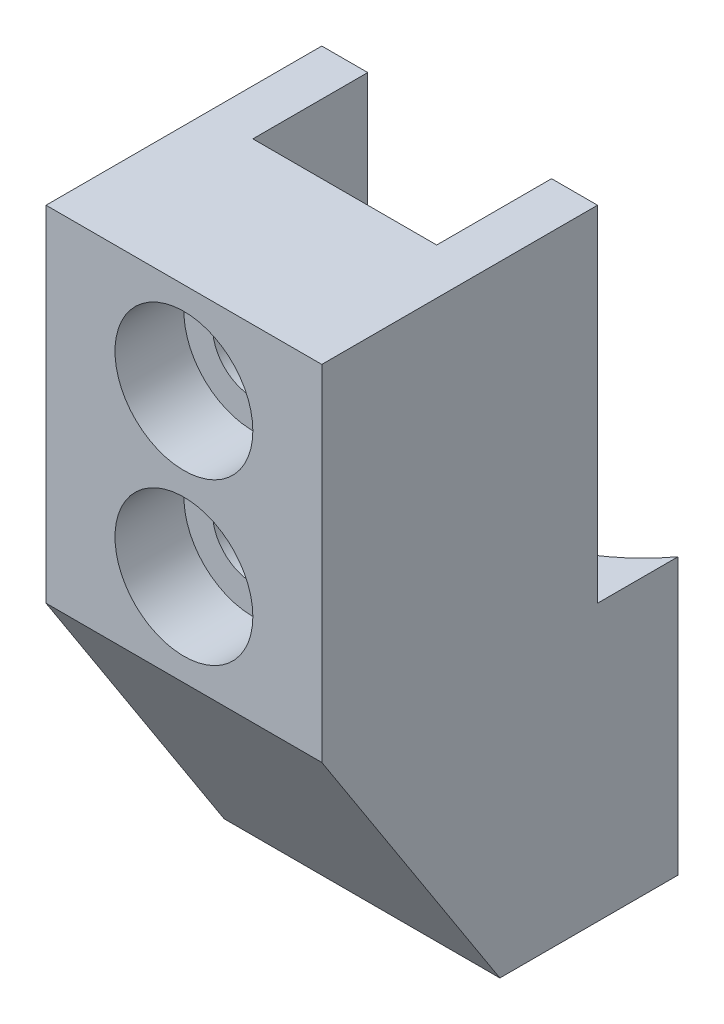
ISO-10303-21;
HEADER;
FILE_DESCRIPTION(('STEP AP214'),'2;1');
FILE_NAME('part.step','',(''),(''),'','','');
FILE_SCHEMA(('AUTOMOTIVE_DESIGN { 1 0 10303 214 1 1 1 1 }'));
ENDSEC;
DATA;
#1=APPLICATION_CONTEXT('core data for automotive mechanical design processes');
#2=APPLICATION_PROTOCOL_DEFINITION('international standard','automotive_design',2000,#1);
#3=PRODUCT_CONTEXT('',#1,'mechanical');
#4=PRODUCT('Part','Part','',(#3));
#5=PRODUCT_RELATED_PRODUCT_CATEGORY('part','',(#4));
#6=PRODUCT_DEFINITION_FORMATION('','',#4);
#7=PRODUCT_DEFINITION_CONTEXT('part definition',#1,'design');
#8=PRODUCT_DEFINITION('design','',#6,#7);
#9=PRODUCT_DEFINITION_SHAPE('','',#8);
#10=(LENGTH_UNIT() NAMED_UNIT(*) SI_UNIT(.MILLI.,.METRE.));
#11=(NAMED_UNIT(*) PLANE_ANGLE_UNIT() SI_UNIT($,.RADIAN.));
#12=(NAMED_UNIT(*) SI_UNIT($,.STERADIAN.) SOLID_ANGLE_UNIT());
#13=UNCERTAINTY_MEASURE_WITH_UNIT(LENGTH_MEASURE(1.E-05),#10,'distance_accuracy_value','');
#14=(GEOMETRIC_REPRESENTATION_CONTEXT(3) GLOBAL_UNCERTAINTY_ASSIGNED_CONTEXT((#13)) GLOBAL_UNIT_ASSIGNED_CONTEXT((#10,
#11,#12)) REPRESENTATION_CONTEXT('',''));
#15=CARTESIAN_POINT('',(0.,0.,0.));
#16=DIRECTION('',(0.,0.,1.));
#17=DIRECTION('',(1.,0.,0.));
#18=AXIS2_PLACEMENT_3D('',#15,#16,#17);
#19=CARTESIAN_POINT('',(6.,-9.,20.));
#20=DIRECTION('',(0.,0.,-1.));
#21=DIRECTION('',(-1.,0.,0.));
#22=AXIS2_PLACEMENT_3D('',#19,#20,#21);
#23=CYLINDRICAL_SURFACE('',#22,1.75);
#24=CARTESIAN_POINT('',(6.,-9.,13.));
#25=DIRECTION('',(0.,0.,-1.));
#26=DIRECTION('',(-1.,0.,0.));
#27=AXIS2_PLACEMENT_3D('',#24,#25,#26);
#28=CIRCLE('',#27,1.75);
#29=CARTESIAN_POINT('',(4.25,-9.,13.));
#30=VERTEX_POINT('',#29);
#31=EDGE_CURVE('E119',#30,#30,#28,.F.);
#32=ORIENTED_EDGE('',*,*,#31,.F.);
#33=EDGE_LOOP('',(#32));
#34=FACE_BOUND('',#33,.T.);
#35=CARTESIAN_POINT('',(6.,-9.,17.));
#36=DIRECTION('',(0.,0.,-1.));
#37=DIRECTION('',(-1.,0.,0.));
#38=AXIS2_PLACEMENT_3D('',#35,#36,#37);
#39=CIRCLE('',#38,1.75);
#40=CARTESIAN_POINT('',(4.25,-9.,17.));
#41=VERTEX_POINT('',#40);
#42=EDGE_CURVE('E20',#41,#41,#39,.T.);
#43=ORIENTED_EDGE('',*,*,#42,.F.);
#44=EDGE_LOOP('',(#43));
#45=FACE_BOUND('',#44,.T.);
#46=ADVANCED_FACE('F17',(#34,#45),#23,.F.);
#47=CARTESIAN_POINT('',(6.,-2.,20.));
#48=DIRECTION('',(0.,0.,-1.));
#49=DIRECTION('',(-1.,0.,0.));
#50=AXIS2_PLACEMENT_3D('',#47,#48,#49);
#51=CYLINDRICAL_SURFACE('',#50,1.75);
#52=CARTESIAN_POINT('',(6.,-2.,13.));
#53=DIRECTION('',(0.,0.,-1.));
#54=DIRECTION('',(-1.,0.,0.));
#55=AXIS2_PLACEMENT_3D('',#52,#53,#54);
#56=CIRCLE('',#55,1.75);
#57=CARTESIAN_POINT('',(4.25,-2.,13.));
#58=VERTEX_POINT('',#57);
#59=EDGE_CURVE('E136',#58,#58,#56,.F.);
#60=ORIENTED_EDGE('',*,*,#59,.F.);
#61=EDGE_LOOP('',(#60));
#62=FACE_BOUND('',#61,.T.);
#63=CARTESIAN_POINT('',(6.,-2.,17.));
#64=DIRECTION('',(0.,0.,-1.));
#65=DIRECTION('',(-1.,0.,0.));
#66=AXIS2_PLACEMENT_3D('',#63,#64,#65);
#67=CIRCLE('',#66,1.75);
#68=CARTESIAN_POINT('',(4.25,-2.,17.));
#69=VERTEX_POINT('',#68);
#70=EDGE_CURVE('E144',#69,#69,#67,.T.);
#71=ORIENTED_EDGE('',*,*,#70,.F.);
#72=EDGE_LOOP('',(#71));
#73=FACE_BOUND('',#72,.T.);
#74=ADVANCED_FACE('F157',(#62,#73),#51,.F.);
#75=CARTESIAN_POINT('',(6.,-9.,17.));
#76=DIRECTION('',(0.,0.,1.));
#77=DIRECTION('',(1.,0.,0.));
#78=AXIS2_PLACEMENT_3D('',#75,#76,#77);
#79=PLANE('',#78);
#80=ORIENTED_EDGE('',*,*,#42,.T.);
#81=EDGE_LOOP('',(#80));
#82=FACE_BOUND('',#81,.T.);
#83=CARTESIAN_POINT('',(6.,-9.,17.));
#84=DIRECTION('',(0.,0.,1.));
#85=DIRECTION('',(1.,0.,0.));
#86=AXIS2_PLACEMENT_3D('',#83,#84,#85);
#87=CIRCLE('',#86,3.);
#88=CARTESIAN_POINT('',(9.,-9.,17.));
#89=VERTEX_POINT('',#88);
#90=EDGE_CURVE('E130',#89,#89,#87,.T.);
#91=ORIENTED_EDGE('',*,*,#90,.T.);
#92=EDGE_LOOP('',(#91));
#93=FACE_BOUND('',#92,.T.);
#94=ADVANCED_FACE('F153',(#82,#93),#79,.T.);
#95=CARTESIAN_POINT('',(6.,-2.,17.));
#96=DIRECTION('',(0.,0.,1.));
#97=DIRECTION('',(1.,0.,0.));
#98=AXIS2_PLACEMENT_3D('',#95,#96,#97);
#99=PLANE('',#98);
#100=ORIENTED_EDGE('',*,*,#70,.T.);
#101=EDGE_LOOP('',(#100));
#102=FACE_BOUND('',#101,.T.);
#103=CARTESIAN_POINT('',(6.,-2.,17.));
#104=DIRECTION('',(0.,0.,1.));
#105=DIRECTION('',(1.,0.,0.));
#106=AXIS2_PLACEMENT_3D('',#103,#104,#105);
#107=CIRCLE('',#106,3.);
#108=CARTESIAN_POINT('',(9.,-2.,17.));
#109=VERTEX_POINT('',#108);
#110=EDGE_CURVE('E205',#109,#109,#107,.T.);
#111=ORIENTED_EDGE('',*,*,#110,.T.);
#112=EDGE_LOOP('',(#111));
#113=FACE_BOUND('',#112,.T.);
#114=ADVANCED_FACE('F211',(#102,#113),#99,.T.);
#115=CARTESIAN_POINT('',(6.,-13.,13.));
#116=DIRECTION('',(0.,0.,-1.));
#117=DIRECTION('',(-1.,0.,0.));
#118=AXIS2_PLACEMENT_3D('',#115,#116,#117);
#119=CYLINDRICAL_SURFACE('',#118,4.);
#120=CARTESIAN_POINT('',(10.,-13.,6.34428877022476));
#121=CARTESIAN_POINT('',(10.0000200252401,-13.1036428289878,6.34425441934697));
#122=CARTESIAN_POINT('',(9.99597255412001,-13.2072663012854,6.34682760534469));
#123=CARTESIAN_POINT('',(9.97990063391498,-13.4135774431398,6.35692958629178));
#124=CARTESIAN_POINT('',(9.96788190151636,-13.5162657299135,6.36445482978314));
#125=CARTESIAN_POINT('',(9.93612748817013,-13.7193053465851,6.38413865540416));
#126=CARTESIAN_POINT('',(9.91644192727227,-13.8196674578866,6.39626713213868));
#127=CARTESIAN_POINT('',(9.86962911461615,-14.018020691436,6.42469608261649));
#128=CARTESIAN_POINT('',(9.84250082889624,-14.1160114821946,6.4409971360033));
#129=CARTESIAN_POINT('',(9.75056464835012,-14.4049846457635,6.49525586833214));
#130=CARTESIAN_POINT('',(9.67509271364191,-14.5916714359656,6.53864362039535));
#131=CARTESIAN_POINT('',(9.49829157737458,-14.9498760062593,6.6349116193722));
#132=CARTESIAN_POINT('',(9.39691648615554,-15.1213661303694,6.68780866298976));
#133=CARTESIAN_POINT('',(9.16011257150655,-15.4618330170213,6.8031330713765));
#134=CARTESIAN_POINT('',(9.02238056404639,-15.6290631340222,6.86598894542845));
#135=CARTESIAN_POINT('',(8.72144722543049,-15.9394593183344,6.99072214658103));
#136=CARTESIAN_POINT('',(8.5582382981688,-16.0826181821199,7.05259917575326));
#137=CARTESIAN_POINT('',(8.28965882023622,-16.2819576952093,7.14264524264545));
#138=CARTESIAN_POINT('',(8.1921823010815,-16.3478730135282,7.17323565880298));
#139=CARTESIAN_POINT('',(7.99119600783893,-16.471169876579,7.23160192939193));
#140=CARTESIAN_POINT('',(7.88768886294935,-16.5285551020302,7.25937899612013));
#141=CARTESIAN_POINT('',(7.67526495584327,-16.6342209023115,7.31132311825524));
#142=CARTESIAN_POINT('',(7.56634845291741,-16.6825019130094,7.33549034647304));
#143=CARTESIAN_POINT('',(7.3439269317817,-16.7693634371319,7.37947812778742));
#144=CARTESIAN_POINT('',(7.23042468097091,-16.8079497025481,7.39930125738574));
#145=CARTESIAN_POINT('',(7.00879426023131,-16.8722838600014,7.4326231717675));
#146=CARTESIAN_POINT('',(6.90094612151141,-16.8988031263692,7.44649689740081));
#147=CARTESIAN_POINT('',(6.68298877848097,-16.9428261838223,7.46964034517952));
#148=CARTESIAN_POINT('',(6.5728807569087,-16.9603345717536,7.47891241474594));
#149=CARTESIAN_POINT('',(6.35132450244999,-16.9861013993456,7.49258866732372));
#150=CARTESIAN_POINT('',(6.23987674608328,-16.9943630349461,7.49699453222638));
#151=CARTESIAN_POINT('',(6.01660039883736,-17.0015246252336,7.50081262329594));
#152=CARTESIAN_POINT('',(5.90477183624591,-17.000425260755,7.50022521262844));
#153=CARTESIAN_POINT('',(5.69277742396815,-16.9894530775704,7.49437900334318));
#154=CARTESIAN_POINT('',(5.59255234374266,-16.9804590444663,7.48958813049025));
#155=CARTESIAN_POINT('',(5.39331309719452,-16.9550013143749,7.47609030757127));
#156=CARTESIAN_POINT('',(5.29429932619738,-16.9385352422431,7.46738211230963));
#157=CARTESIAN_POINT('',(5.00018393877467,-16.8781849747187,7.43566337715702));
#158=CARTESIAN_POINT('',(4.80780565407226,-16.8233378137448,7.40705252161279));
#159=CARTESIAN_POINT('',(4.43322849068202,-16.6858642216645,7.33703494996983));
#160=CARTESIAN_POINT('',(4.25117943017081,-16.6029124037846,7.29547883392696));
#161=CARTESIAN_POINT('',(3.90316829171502,-16.4121398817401,7.20317484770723));
#162=CARTESIAN_POINT('',(3.73721176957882,-16.3043106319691,7.15242382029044));
#163=CARTESIAN_POINT('',(3.4077759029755,-16.0540908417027,7.04014988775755));
#164=CARTESIAN_POINT('',(3.24632957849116,-15.9092786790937,6.97805575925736));
#165=CARTESIAN_POINT('',(2.94882551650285,-15.5956078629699,6.853205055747));
#166=CARTESIAN_POINT('',(2.81279624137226,-15.426722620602,6.79044782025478));
#167=CARTESIAN_POINT('',(2.55916455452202,-15.0531632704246,6.66574839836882));
#168=CARTESIAN_POINT('',(2.44390783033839,-14.8467067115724,6.60427331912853));
#169=CARTESIAN_POINT('',(2.29906428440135,-14.5222055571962,6.52350624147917));
#170=CARTESIAN_POINT('',(2.25547687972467,-14.4116495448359,6.49850462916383));
#171=CARTESIAN_POINT('',(2.1780878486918,-14.186245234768,6.4532928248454));
#172=CARTESIAN_POINT('',(2.14428209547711,-14.0713987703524,6.43308061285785));
#173=CARTESIAN_POINT('',(2.07759842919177,-13.8000642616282,6.39271373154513));
#174=CARTESIAN_POINT('',(2.0486407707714,-13.6422427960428,6.37474032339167));
#175=CARTESIAN_POINT('',(2.01953323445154,-13.4029783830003,6.35657138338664));
#176=CARTESIAN_POINT('',(2.01221870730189,-13.3226595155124,6.35197997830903));
#177=CARTESIAN_POINT('',(2.00244970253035,-13.1615712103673,6.34583398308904));
#178=CARTESIAN_POINT('',(1.99999766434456,-13.0808015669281,6.34428091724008));
#179=CARTESIAN_POINT('',(2.,-13.,6.34428877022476));
#180=B_SPLINE_CURVE_WITH_KNOTS('',3,(#120,#121,#122,#123,#124,#125,#126,#127,#128,#129,#130,
#131,#132,#133,#134,#135,#136,#137,#138,#139,#140,#141,#142,#143,#144,#145,#146,#147,#148,#149,
#150,#151,#152,#153,#154,#155,#156,#157,#158,#159,#160,#161,#162,#163,#164,#165,#166,#167,#168,
#169,#170,#171,#172,#173,#174,#175,#176,#177,#178,#179),.UNSPECIFIED.,.F.,.F.,(4,2,2,2,2,2,2,2,
2,2,2,2,2,2,2,2,2,2,2,2,2,2,2,2,2,2,2,2,2,4),(0.,0.310785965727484,0.621349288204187,
0.929915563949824,1.23852472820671,1.85362075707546,2.46981412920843,3.14384278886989,
3.81807279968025,4.18241517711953,4.54659988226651,4.91076714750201,5.27471783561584,
5.6100263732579,5.94516368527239,6.28018512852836,6.61518220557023,6.91703548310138,
7.21898477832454,7.82228211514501,8.43281750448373,9.0435629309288,9.71750167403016,
10.3921906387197,11.1208706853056,11.4847148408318,11.8484052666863,12.3310545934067,
12.57322380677,12.8155144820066),.UNSPECIFIED.);
#181=CARTESIAN_POINT('',(10.,-13.,6.34428877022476));
#182=VERTEX_POINT('',#181);
#183=CARTESIAN_POINT('',(2.,-13.,6.34428877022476));
#184=VERTEX_POINT('',#183);
#185=EDGE_CURVE('E196',#182,#184,#180,.T.);
#186=ORIENTED_EDGE('',*,*,#185,.T.);
#187=DIRECTION('',(0.,0.,-1.));
#188=VECTOR('',#187,1.);
#189=CARTESIAN_POINT('',(2.,-13.,7.5));
#190=LINE('',#189,#188);
#191=CARTESIAN_POINT('',(2.,-13.,8.));
#192=VERTEX_POINT('',#191);
#193=EDGE_CURVE('E115',#184,#192,#190,.F.);
#194=ORIENTED_EDGE('',*,*,#193,.T.);
#195=DIRECTION('',(0.,0.,1.));
#196=VECTOR('',#195,1.);
#197=CARTESIAN_POINT('',(2.,-13.,13.));
#198=LINE('',#197,#196);
#199=CARTESIAN_POINT('',(2.,-13.,13.));
#200=VERTEX_POINT('',#199);
#201=EDGE_CURVE('E108',#192,#200,#198,.T.);
#202=ORIENTED_EDGE('',*,*,#201,.T.);
#203=CARTESIAN_POINT('',(6.,-13.,13.));
#204=DIRECTION('',(0.,0.,-1.));
#205=DIRECTION('',(-1.,0.,0.));
#206=AXIS2_PLACEMENT_3D('',#203,#204,#205);
#207=CIRCLE('',#206,4.);
#208=CARTESIAN_POINT('',(10.,-13.,13.));
#209=VERTEX_POINT('',#208);
#210=EDGE_CURVE('E112',#209,#200,#207,.T.);
#211=ORIENTED_EDGE('',*,*,#210,.F.);
#212=DIRECTION('',(0.,0.,1.));
#213=VECTOR('',#212,1.);
#214=CARTESIAN_POINT('',(10.,-13.,13.));
#215=LINE('',#214,#213);
#216=CARTESIAN_POINT('',(10.,-13.,8.));
#217=VERTEX_POINT('',#216);
#218=EDGE_CURVE('E103',#209,#217,#215,.F.);
#219=ORIENTED_EDGE('',*,*,#218,.T.);
#220=DIRECTION('',(0.,0.,-1.));
#221=VECTOR('',#220,1.);
#222=CARTESIAN_POINT('',(10.,-13.,13.));
#223=LINE('',#222,#221);
#224=EDGE_CURVE('E146',#182,#217,#223,.F.);
#225=ORIENTED_EDGE('',*,*,#224,.F.);
#226=EDGE_LOOP('',(#186,#194,#202,#211,#219,#225));
#227=FACE_BOUND('',#226,.T.);
#228=ADVANCED_FACE('F110',(#227),#119,.F.);
#229=CARTESIAN_POINT('',(0.,-13.,7.5));
#230=DIRECTION('',(0.,-1.,0.));
#231=DIRECTION('',(0.,0.,-1.));
#232=AXIS2_PLACEMENT_3D('',#229,#230,#231);
#233=PLANE('',#232);
#234=CARTESIAN_POINT('',(6.,-13.,0.));
#235=DIRECTION('',(0.,-1.,0.));
#236=DIRECTION('',(0.,0.,-1.));
#237=AXIS2_PLACEMENT_3D('',#234,#235,#236);
#238=CIRCLE('',#237,7.5);
#239=CARTESIAN_POINT('',(0.,-13.,4.5));
#240=VERTEX_POINT('',#239);
#241=EDGE_CURVE('E202',#184,#240,#238,.T.);
#242=ORIENTED_EDGE('',*,*,#241,.T.);
#243=DIRECTION('',(0.,0.,-1.));
#244=VECTOR('',#243,1.);
#245=CARTESIAN_POINT('',(0.,-13.,0.));
#246=LINE('',#245,#244);
#247=CARTESIAN_POINT('',(0.,-13.,8.));
#248=VERTEX_POINT('',#247);
#249=EDGE_CURVE('E437',#240,#248,#246,.F.);
#250=ORIENTED_EDGE('',*,*,#249,.T.);
#251=DIRECTION('',(1.,0.,0.));
#252=VECTOR('',#251,1.);
#253=CARTESIAN_POINT('',(12.,-13.,8.));
#254=LINE('',#253,#252);
#255=EDGE_CURVE('E422',#248,#192,#254,.T.);
#256=ORIENTED_EDGE('',*,*,#255,.T.);
#257=ORIENTED_EDGE('',*,*,#193,.F.);
#258=EDGE_LOOP('',(#242,#250,#256,#257));
#259=FACE_BOUND('',#258,.T.);
#260=ADVANCED_FACE('F210',(#259),#233,.F.);
#261=CARTESIAN_POINT('',(10.,2.,13.));
#262=DIRECTION('',(1.,0.,0.));
#263=DIRECTION('',(0.,1.,0.));
#264=AXIS2_PLACEMENT_3D('',#261,#262,#263);
#265=PLANE('',#264);
#266=DIRECTION('',(0.,1.,0.));
#267=VECTOR('',#266,1.);
#268=CARTESIAN_POINT('',(10.,2.,13.));
#269=LINE('',#268,#267);
#270=CARTESIAN_POINT('',(10.,2.,13.));
#271=VERTEX_POINT('',#270);
#272=EDGE_CURVE('E134',#271,#209,#269,.F.);
#273=ORIENTED_EDGE('',*,*,#272,.F.);
#274=DIRECTION('',(0.,0.,-1.));
#275=VECTOR('',#274,1.);
#276=CARTESIAN_POINT('',(10.,2.,20.));
#277=LINE('',#276,#275);
#278=CARTESIAN_POINT('',(10.,2.,8.));
#279=VERTEX_POINT('',#278);
#280=EDGE_CURVE('E425',#271,#279,#277,.T.);
#281=ORIENTED_EDGE('',*,*,#280,.T.);
#282=DIRECTION('',(0.,1.,0.));
#283=VECTOR('',#282,1.);
#284=CARTESIAN_POINT('',(10.,-13.,8.));
#285=LINE('',#284,#283);
#286=EDGE_CURVE('E415',#279,#217,#285,.F.);
#287=ORIENTED_EDGE('',*,*,#286,.T.);
#288=ORIENTED_EDGE('',*,*,#218,.F.);
#289=EDGE_LOOP('',(#273,#281,#287,#288));
#290=FACE_BOUND('',#289,.T.);
#291=ADVANCED_FACE('F236',(#290),#265,.F.);
#292=CARTESIAN_POINT('',(12.,-13.,8.));
#293=DIRECTION('',(0.,0.,1.));
#294=DIRECTION('',(1.,0.,0.));
#295=AXIS2_PLACEMENT_3D('',#292,#293,#294);
#296=PLANE('',#295);
#297=DIRECTION('',(0.,-1.,0.));
#298=VECTOR('',#297,1.);
#299=CARTESIAN_POINT('',(2.,2.,8.));
#300=LINE('',#299,#298);
#301=CARTESIAN_POINT('',(2.,2.,8.));
#302=VERTEX_POINT('',#301);
#303=EDGE_CURVE('E120',#302,#192,#300,.T.);
#304=ORIENTED_EDGE('',*,*,#303,.T.);
#305=ORIENTED_EDGE('',*,*,#255,.F.);
#306=DIRECTION('',(0.,1.,0.));
#307=VECTOR('',#306,1.);
#308=CARTESIAN_POINT('',(0.,0.,8.));
#309=LINE('',#308,#307);
#310=CARTESIAN_POINT('',(0.,2.,8.));
#311=VERTEX_POINT('',#310);
#312=EDGE_CURVE('E404',#248,#311,#309,.T.);
#313=ORIENTED_EDGE('',*,*,#312,.T.);
#314=DIRECTION('',(1.,0.,0.));
#315=VECTOR('',#314,1.);
#316=CARTESIAN_POINT('',(0.,2.,8.));
#317=LINE('',#316,#315);
#318=EDGE_CURVE('E456',#311,#302,#317,.T.);
#319=ORIENTED_EDGE('',*,*,#318,.T.);
#320=EDGE_LOOP('',(#304,#305,#313,#319));
#321=FACE_BOUND('',#320,.T.);
#322=ADVANCED_FACE('F243',(#321),#296,.F.);
#323=CARTESIAN_POINT('',(2.,2.,13.));
#324=DIRECTION('',(-1.,0.,0.));
#325=DIRECTION('',(0.,-1.,0.));
#326=AXIS2_PLACEMENT_3D('',#323,#324,#325);
#327=PLANE('',#326);
#328=DIRECTION('',(0.,1.,0.));
#329=VECTOR('',#328,1.);
#330=CARTESIAN_POINT('',(2.,2.,13.));
#331=LINE('',#330,#329);
#332=CARTESIAN_POINT('',(2.,2.,13.));
#333=VERTEX_POINT('',#332);
#334=EDGE_CURVE('E123',#200,#333,#331,.T.);
#335=ORIENTED_EDGE('',*,*,#334,.F.);
#336=ORIENTED_EDGE('',*,*,#201,.F.);
#337=ORIENTED_EDGE('',*,*,#303,.F.);
#338=DIRECTION('',(0.,0.,-1.));
#339=VECTOR('',#338,1.);
#340=CARTESIAN_POINT('',(2.,2.,20.));
#341=LINE('',#340,#339);
#342=EDGE_CURVE('E126',#302,#333,#341,.F.);
#343=ORIENTED_EDGE('',*,*,#342,.T.);
#344=EDGE_LOOP('',(#335,#336,#337,#343));
#345=FACE_BOUND('',#344,.T.);
#346=ADVANCED_FACE('F124',(#345),#327,.F.);
#347=CARTESIAN_POINT('',(6.,2.,13.));
#348=DIRECTION('',(0.,0.,-1.));
#349=DIRECTION('',(-1.,0.,0.));
#350=AXIS2_PLACEMENT_3D('',#347,#348,#349);
#351=PLANE('',#350);
#352=ORIENTED_EDGE('',*,*,#210,.T.);
#353=ORIENTED_EDGE('',*,*,#334,.T.);
#354=DIRECTION('',(1.,0.,0.));
#355=VECTOR('',#354,1.);
#356=CARTESIAN_POINT('',(0.,2.,13.));
#357=LINE('',#356,#355);
#358=EDGE_CURVE('E455',#333,#271,#357,.T.);
#359=ORIENTED_EDGE('',*,*,#358,.T.);
#360=ORIENTED_EDGE('',*,*,#272,.T.);
#361=EDGE_LOOP('',(#352,#353,#359,#360));
#362=FACE_BOUND('',#361,.T.);
#363=ORIENTED_EDGE('',*,*,#59,.T.);
#364=EDGE_LOOP('',(#363));
#365=FACE_BOUND('',#364,.T.);
#366=ORIENTED_EDGE('',*,*,#31,.T.);
#367=EDGE_LOOP('',(#366));
#368=FACE_BOUND('',#367,.T.);
#369=ADVANCED_FACE('F132',(#362,#365,#368),#351,.T.);
#370=CARTESIAN_POINT('',(6.,-9.,17.));
#371=DIRECTION('',(0.,0.,1.));
#372=DIRECTION('',(1.,0.,0.));
#373=AXIS2_PLACEMENT_3D('',#370,#371,#372);
#374=CYLINDRICAL_SURFACE('',#373,3.);
#375=ORIENTED_EDGE('',*,*,#90,.F.);
#376=EDGE_LOOP('',(#375));
#377=FACE_BOUND('',#376,.T.);
#378=CARTESIAN_POINT('',(6.,-9.,20.));
#379=DIRECTION('',(0.,0.,1.));
#380=DIRECTION('',(1.,0.,0.));
#381=AXIS2_PLACEMENT_3D('',#378,#379,#380);
#382=CIRCLE('',#381,3.);
#383=CARTESIAN_POINT('',(9.,-9.,20.));
#384=VERTEX_POINT('',#383);
#385=EDGE_CURVE('E460',#384,#384,#382,.T.);
#386=ORIENTED_EDGE('',*,*,#385,.T.);
#387=EDGE_LOOP('',(#386));
#388=FACE_BOUND('',#387,.T.);
#389=ADVANCED_FACE('F262',(#377,#388),#374,.F.);
#390=CARTESIAN_POINT('',(6.,-2.,17.));
#391=DIRECTION('',(0.,0.,1.));
#392=DIRECTION('',(1.,0.,0.));
#393=AXIS2_PLACEMENT_3D('',#390,#391,#392);
#394=CYLINDRICAL_SURFACE('',#393,3.);
#395=ORIENTED_EDGE('',*,*,#110,.F.);
#396=EDGE_LOOP('',(#395));
#397=FACE_BOUND('',#396,.T.);
#398=CARTESIAN_POINT('',(6.,-2.,20.));
#399=DIRECTION('',(0.,0.,1.));
#400=DIRECTION('',(1.,0.,0.));
#401=AXIS2_PLACEMENT_3D('',#398,#399,#400);
#402=CIRCLE('',#401,3.);
#403=CARTESIAN_POINT('',(9.,-2.,20.));
#404=VERTEX_POINT('',#403);
#405=EDGE_CURVE('E470',#404,#404,#402,.T.);
#406=ORIENTED_EDGE('',*,*,#405,.T.);
#407=EDGE_LOOP('',(#406));
#408=FACE_BOUND('',#407,.T.);
#409=ADVANCED_FACE('F269',(#397,#408),#394,.F.);
#410=CARTESIAN_POINT('',(0.,0.,0.));
#411=DIRECTION('',(1.,0.,0.));
#412=DIRECTION('',(0.,0.,-1.));
#413=AXIS2_PLACEMENT_3D('',#410,#411,#412);
#414=PLANE('',#413);
#415=DIRECTION('',(0.,0.840039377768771,0.542525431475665));
#416=VECTOR('',#415,1.);
#417=CARTESIAN_POINT('',(0.,-25.,12.25));
#418=LINE('',#417,#416);
#419=CARTESIAN_POINT('',(0.,-25.,12.25));
#420=VERTEX_POINT('',#419);
#421=CARTESIAN_POINT('',(0.,-13.,20.));
#422=VERTEX_POINT('',#421);
#423=EDGE_CURVE('E384',#420,#422,#418,.T.);
#424=ORIENTED_EDGE('',*,*,#423,.T.);
#425=DIRECTION('',(0.,1.,0.));
#426=VECTOR('',#425,1.);
#427=CARTESIAN_POINT('',(0.,25.,20.));
#428=LINE('',#427,#426);
#429=CARTESIAN_POINT('',(0.,2.,20.));
#430=VERTEX_POINT('',#429);
#431=EDGE_CURVE('E393',#422,#430,#428,.T.);
#432=ORIENTED_EDGE('',*,*,#431,.T.);
#433=DIRECTION('',(0.,0.,-1.));
#434=VECTOR('',#433,1.);
#435=CARTESIAN_POINT('',(0.,2.,20.));
#436=LINE('',#435,#434);
#437=EDGE_CURVE('E431',#430,#311,#436,.T.);
#438=ORIENTED_EDGE('',*,*,#437,.T.);
#439=ORIENTED_EDGE('',*,*,#312,.F.);
#440=ORIENTED_EDGE('',*,*,#249,.F.);
#441=DIRECTION('',(0.,-1.,0.));
#442=VECTOR('',#441,1.);
#443=CARTESIAN_POINT('',(0.,-21.,4.5));
#444=LINE('',#443,#442);
#445=CARTESIAN_POINT('',(0.,-25.,4.5));
#446=VERTEX_POINT('',#445);
#447=EDGE_CURVE('E434',#240,#446,#444,.T.);
#448=ORIENTED_EDGE('',*,*,#447,.T.);
#449=DIRECTION('',(0.,0.,1.));
#450=VECTOR('',#449,1.);
#451=CARTESIAN_POINT('',(0.,-25.,20.));
#452=LINE('',#451,#450);
#453=EDGE_CURVE('E377',#446,#420,#452,.T.);
#454=ORIENTED_EDGE('',*,*,#453,.T.);
#455=EDGE_LOOP('',(#424,#432,#438,#439,#440,#448,#454));
#456=FACE_BOUND('',#455,.T.);
#457=ADVANCED_FACE('F277',(#456),#414,.F.);
#458=CARTESIAN_POINT('',(0.,-25.,12.25));
#459=DIRECTION('',(0.,0.542525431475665,-0.840039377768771));
#460=DIRECTION('',(0.,0.840039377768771,0.542525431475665));
#461=AXIS2_PLACEMENT_3D('',#458,#459,#460);
#462=PLANE('',#461);
#463=DIRECTION('',(1.,0.,0.));
#464=VECTOR('',#463,1.);
#465=CARTESIAN_POINT('',(12.,-13.,20.));
#466=LINE('',#465,#464);
#467=CARTESIAN_POINT('',(12.,-13.,20.));
#468=VERTEX_POINT('',#467);
#469=EDGE_CURVE('E396',#468,#422,#466,.F.);
#470=ORIENTED_EDGE('',*,*,#469,.T.);
#471=ORIENTED_EDGE('',*,*,#423,.F.);
#472=DIRECTION('',(1.,0.,0.));
#473=VECTOR('',#472,1.);
#474=CARTESIAN_POINT('',(12.,-25.,12.25));
#475=LINE('',#474,#473);
#476=CARTESIAN_POINT('',(12.,-25.,12.25));
#477=VERTEX_POINT('',#476);
#478=EDGE_CURVE('E203',#420,#477,#475,.T.);
#479=ORIENTED_EDGE('',*,*,#478,.T.);
#480=DIRECTION('',(0.,-0.840039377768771,-0.542525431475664));
#481=VECTOR('',#480,1.);
#482=CARTESIAN_POINT('',(12.,-13.,20.));
#483=LINE('',#482,#481);
#484=EDGE_CURVE('E391',#468,#477,#483,.T.);
#485=ORIENTED_EDGE('',*,*,#484,.F.);
#486=EDGE_LOOP('',(#470,#471,#479,#485));
#487=FACE_BOUND('',#486,.T.);
#488=ADVANCED_FACE('F285',(#487),#462,.F.);
#489=CARTESIAN_POINT('',(12.,-25.,20.));
#490=DIRECTION('',(0.,1.,0.));
#491=DIRECTION('',(0.,0.,1.));
#492=AXIS2_PLACEMENT_3D('',#489,#490,#491);
#493=PLANE('',#492);
#494=ORIENTED_EDGE('',*,*,#478,.F.);
#495=ORIENTED_EDGE('',*,*,#453,.F.);
#496=CARTESIAN_POINT('',(6.,-25.,0.));
#497=DIRECTION('',(0.,-1.,0.));
#498=DIRECTION('',(0.,0.,-1.));
#499=AXIS2_PLACEMENT_3D('',#496,#497,#498);
#500=CIRCLE('',#499,7.5);
#501=CARTESIAN_POINT('',(12.,-25.,4.5));
#502=VERTEX_POINT('',#501);
#503=EDGE_CURVE('E436',#446,#502,#500,.F.);
#504=ORIENTED_EDGE('',*,*,#503,.T.);
#505=DIRECTION('',(0.,0.,-1.));
#506=VECTOR('',#505,1.);
#507=CARTESIAN_POINT('',(12.,-25.,0.));
#508=LINE('',#507,#506);
#509=EDGE_CURVE('E380',#477,#502,#508,.T.);
#510=ORIENTED_EDGE('',*,*,#509,.F.);
#511=EDGE_LOOP('',(#494,#495,#504,#510));
#512=FACE_BOUND('',#511,.T.);
#513=ADVANCED_FACE('F192',(#512),#493,.F.);
#514=CARTESIAN_POINT('',(6.,-21.,0.));
#515=DIRECTION('',(0.,-1.,0.));
#516=DIRECTION('',(0.,0.,-1.));
#517=AXIS2_PLACEMENT_3D('',#514,#515,#516);
#518=CYLINDRICAL_SURFACE('',#517,7.5);
#519=ORIENTED_EDGE('',*,*,#503,.F.);
#520=ORIENTED_EDGE('',*,*,#447,.F.);
#521=ORIENTED_EDGE('',*,*,#241,.F.);
#522=ORIENTED_EDGE('',*,*,#185,.F.);
#523=CARTESIAN_POINT('',(6.,-13.,0.));
#524=DIRECTION('',(0.,-1.,0.));
#525=DIRECTION('',(0.,0.,-1.));
#526=AXIS2_PLACEMENT_3D('',#523,#524,#525);
#527=CIRCLE('',#526,7.5);
#528=CARTESIAN_POINT('',(12.,-13.,4.5));
#529=VERTEX_POINT('',#528);
#530=EDGE_CURVE('E418',#182,#529,#527,.F.);
#531=ORIENTED_EDGE('',*,*,#530,.T.);
#532=DIRECTION('',(0.,1.,0.));
#533=VECTOR('',#532,1.);
#534=CARTESIAN_POINT('',(12.,0.,4.5));
#535=LINE('',#534,#533);
#536=EDGE_CURVE('E478',#502,#529,#535,.T.);
#537=ORIENTED_EDGE('',*,*,#536,.F.);
#538=EDGE_LOOP('',(#519,#520,#521,#522,#531,#537));
#539=FACE_BOUND('',#538,.T.);
#540=ADVANCED_FACE('F187',(#539),#518,.F.);
#541=CARTESIAN_POINT('',(0.,-13.,7.5));
#542=DIRECTION('',(0.,-1.,0.));
#543=DIRECTION('',(0.,0.,-1.));
#544=AXIS2_PLACEMENT_3D('',#541,#542,#543);
#545=PLANE('',#544);
#546=ORIENTED_EDGE('',*,*,#530,.F.);
#547=ORIENTED_EDGE('',*,*,#224,.T.);
#548=DIRECTION('',(1.,0.,0.));
#549=VECTOR('',#548,1.);
#550=CARTESIAN_POINT('',(12.,-13.,8.));
#551=LINE('',#550,#549);
#552=CARTESIAN_POINT('',(12.,-13.,8.));
#553=VERTEX_POINT('',#552);
#554=EDGE_CURVE('E417',#217,#553,#551,.T.);
#555=ORIENTED_EDGE('',*,*,#554,.T.);
#556=DIRECTION('',(0.,0.,-1.));
#557=VECTOR('',#556,1.);
#558=CARTESIAN_POINT('',(12.,-13.,0.));
#559=LINE('',#558,#557);
#560=EDGE_CURVE('E483',#529,#553,#559,.F.);
#561=ORIENTED_EDGE('',*,*,#560,.F.);
#562=EDGE_LOOP('',(#546,#547,#555,#561));
#563=FACE_BOUND('',#562,.T.);
#564=ADVANCED_FACE('F183',(#563),#545,.F.);
#565=CARTESIAN_POINT('',(12.,-13.,8.));
#566=DIRECTION('',(0.,0.,1.));
#567=DIRECTION('',(1.,0.,0.));
#568=AXIS2_PLACEMENT_3D('',#565,#566,#567);
#569=PLANE('',#568);
#570=ORIENTED_EDGE('',*,*,#286,.F.);
#571=DIRECTION('',(1.,0.,0.));
#572=VECTOR('',#571,1.);
#573=CARTESIAN_POINT('',(0.,2.,8.));
#574=LINE('',#573,#572);
#575=CARTESIAN_POINT('',(12.,2.,8.));
#576=VERTEX_POINT('',#575);
#577=EDGE_CURVE('E427',#279,#576,#574,.T.);
#578=ORIENTED_EDGE('',*,*,#577,.T.);
#579=DIRECTION('',(0.,1.,0.));
#580=VECTOR('',#579,1.);
#581=CARTESIAN_POINT('',(12.,0.,8.));
#582=LINE('',#581,#580);
#583=EDGE_CURVE('E494',#553,#576,#582,.T.);
#584=ORIENTED_EDGE('',*,*,#583,.F.);
#585=ORIENTED_EDGE('',*,*,#554,.F.);
#586=EDGE_LOOP('',(#570,#578,#584,#585));
#587=FACE_BOUND('',#586,.T.);
#588=ADVANCED_FACE('F180',(#587),#569,.F.);
#589=CARTESIAN_POINT('',(0.,2.,20.));
#590=DIRECTION('',(0.,-1.,0.));
#591=DIRECTION('',(0.,0.,-1.));
#592=AXIS2_PLACEMENT_3D('',#589,#590,#591);
#593=PLANE('',#592);
#594=ORIENTED_EDGE('',*,*,#342,.F.);
#595=ORIENTED_EDGE('',*,*,#318,.F.);
#596=ORIENTED_EDGE('',*,*,#437,.F.);
#597=DIRECTION('',(1.,0.,0.));
#598=VECTOR('',#597,1.);
#599=CARTESIAN_POINT('',(12.,2.,20.));
#600=LINE('',#599,#598);
#601=CARTESIAN_POINT('',(12.,2.,20.));
#602=VERTEX_POINT('',#601);
#603=EDGE_CURVE('E35',#430,#602,#600,.T.);
#604=ORIENTED_EDGE('',*,*,#603,.T.);
#605=DIRECTION('',(0.,0.,-1.));
#606=VECTOR('',#605,1.);
#607=CARTESIAN_POINT('',(12.,2.,0.));
#608=LINE('',#607,#606);
#609=EDGE_CURVE('E26',#576,#602,#608,.F.);
#610=ORIENTED_EDGE('',*,*,#609,.F.);
#611=ORIENTED_EDGE('',*,*,#577,.F.);
#612=ORIENTED_EDGE('',*,*,#280,.F.);
#613=ORIENTED_EDGE('',*,*,#358,.F.);
#614=EDGE_LOOP('',(#594,#595,#596,#604,#610,#611,#612,#613));
#615=FACE_BOUND('',#614,.T.);
#616=ADVANCED_FACE('F173',(#615),#593,.F.);
#617=CARTESIAN_POINT('',(12.,25.,20.));
#618=DIRECTION('',(0.,0.,-1.));
#619=DIRECTION('',(0.,1.,0.));
#620=AXIS2_PLACEMENT_3D('',#617,#618,#619);
#621=PLANE('',#620);
#622=ORIENTED_EDGE('',*,*,#469,.F.);
#623=DIRECTION('',(0.,1.,0.));
#624=VECTOR('',#623,1.);
#625=CARTESIAN_POINT('',(12.,0.,20.));
#626=LINE('',#625,#624);
#627=EDGE_CURVE('E11',#602,#468,#626,.F.);
#628=ORIENTED_EDGE('',*,*,#627,.F.);
#629=ORIENTED_EDGE('',*,*,#603,.F.);
#630=ORIENTED_EDGE('',*,*,#431,.F.);
#631=EDGE_LOOP('',(#622,#628,#629,#630));
#632=FACE_BOUND('',#631,.T.);
#633=ORIENTED_EDGE('',*,*,#405,.F.);
#634=EDGE_LOOP('',(#633));
#635=FACE_BOUND('',#634,.T.);
#636=ORIENTED_EDGE('',*,*,#385,.F.);
#637=EDGE_LOOP('',(#636));
#638=FACE_BOUND('',#637,.T.);
#639=ADVANCED_FACE('F167',(#632,#635,#638),#621,.F.);
#640=CARTESIAN_POINT('',(12.,0.,0.));
#641=DIRECTION('',(1.,0.,0.));
#642=DIRECTION('',(0.,0.,-1.));
#643=AXIS2_PLACEMENT_3D('',#640,#641,#642);
#644=PLANE('',#643);
#645=ORIENTED_EDGE('',*,*,#609,.T.);
#646=ORIENTED_EDGE('',*,*,#627,.T.);
#647=ORIENTED_EDGE('',*,*,#484,.T.);
#648=ORIENTED_EDGE('',*,*,#509,.T.);
#649=ORIENTED_EDGE('',*,*,#536,.T.);
#650=ORIENTED_EDGE('',*,*,#560,.T.);
#651=ORIENTED_EDGE('',*,*,#583,.T.);
#652=EDGE_LOOP('',(#645,#646,#647,#648,#649,#650,#651));
#653=FACE_BOUND('',#652,.T.);
#654=ADVANCED_FACE('F165',(#653),#644,.T.);
#655=CLOSED_SHELL('',(#46,#74,#94,#114,#228,#260,#291,#322,#346,#369,#389,#409,#457,#488,#513,
#540,#564,#588,#616,#639,#654));
#656=MANIFOLD_SOLID_BREP('B1',#655);
#657=ADVANCED_BREP_SHAPE_REPRESENTATION('',(#18,#656),#14);
#658=SHAPE_DEFINITION_REPRESENTATION(#9,#657);
ENDSEC;
END-ISO-10303-21;
